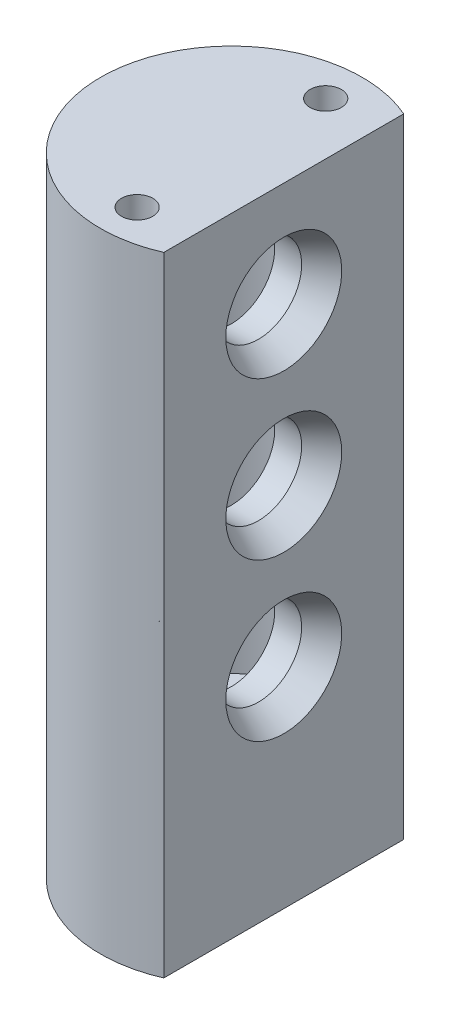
ISO-10303-21;
HEADER;
FILE_DESCRIPTION(('STEP AP214'),'2;1');
FILE_NAME('part.step','',(''),(''),'','','');
FILE_SCHEMA(('AUTOMOTIVE_DESIGN { 1 0 10303 214 1 1 1 1 }'));
ENDSEC;
DATA;
#1=APPLICATION_CONTEXT('core data for automotive mechanical design processes');
#2=APPLICATION_PROTOCOL_DEFINITION('international standard','automotive_design',2000,#1);
#3=PRODUCT_CONTEXT('',#1,'mechanical');
#4=PRODUCT('Part','Part','',(#3));
#5=PRODUCT_RELATED_PRODUCT_CATEGORY('part','',(#4));
#6=PRODUCT_DEFINITION_FORMATION('','',#4);
#7=PRODUCT_DEFINITION_CONTEXT('part definition',#1,'design');
#8=PRODUCT_DEFINITION('design','',#6,#7);
#9=PRODUCT_DEFINITION_SHAPE('','',#8);
#10=(LENGTH_UNIT() NAMED_UNIT(*) SI_UNIT(.MILLI.,.METRE.));
#11=(NAMED_UNIT(*) PLANE_ANGLE_UNIT() SI_UNIT($,.RADIAN.));
#12=(NAMED_UNIT(*) SI_UNIT($,.STERADIAN.) SOLID_ANGLE_UNIT());
#13=UNCERTAINTY_MEASURE_WITH_UNIT(LENGTH_MEASURE(1.E-05),#10,'distance_accuracy_value','');
#14=(GEOMETRIC_REPRESENTATION_CONTEXT(3) GLOBAL_UNCERTAINTY_ASSIGNED_CONTEXT((#13)) GLOBAL_UNIT_ASSIGNED_CONTEXT((#10,
#11,#12)) REPRESENTATION_CONTEXT('',''));
#15=CARTESIAN_POINT('',(0.,0.,0.));
#16=DIRECTION('',(0.,0.,1.));
#17=DIRECTION('',(1.,0.,0.));
#18=AXIS2_PLACEMENT_3D('',#15,#16,#17);
#19=CARTESIAN_POINT('',(0.,71.12,0.));
#20=DIRECTION('',(0.,1.,0.));
#21=DIRECTION('',(0.,0.,1.));
#22=AXIS2_PLACEMENT_3D('',#19,#20,#21);
#23=PLANE('',#22);
#24=CARTESIAN_POINT('',(0.,71.12,0.));
#25=DIRECTION('',(0.,1.,0.));
#26=DIRECTION('',(0.,0.,1.));
#27=AXIS2_PLACEMENT_3D('',#24,#25,#26);
#28=CIRCLE('',#27,8.89);
#29=CARTESIAN_POINT('',(0.,71.12,-8.89));
#30=VERTEX_POINT('',#29);
#31=CARTESIAN_POINT('',(0.,71.12,8.89));
#32=VERTEX_POINT('',#31);
#33=EDGE_CURVE('E178',#30,#32,#28,.T.);
#34=ORIENTED_EDGE('',*,*,#33,.F.);
#35=DIRECTION('',(0.,0.,-1.));
#36=VECTOR('',#35,1.);
#37=CARTESIAN_POINT('',(0.,71.12,8.89));
#38=LINE('',#37,#36);
#39=EDGE_CURVE('E163',#32,#30,#38,.T.);
#40=ORIENTED_EDGE('',*,*,#39,.F.);
#41=EDGE_LOOP('',(#34,#40));
#42=FACE_BOUND('',#41,.T.);
#43=CARTESIAN_POINT('',(-6.11480234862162,71.12,0.));
#44=DIRECTION('',(0.,1.,0.));
#45=DIRECTION('',(0.,0.,1.));
#46=AXIS2_PLACEMENT_3D('',#43,#44,#45);
#47=CIRCLE('',#46,1.524);
#48=CARTESIAN_POINT('',(-6.11480234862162,71.12,1.524));
#49=VERTEX_POINT('',#48);
#50=EDGE_CURVE('E209',#49,#49,#47,.F.);
#51=ORIENTED_EDGE('',*,*,#50,.F.);
#52=EDGE_LOOP('',(#51));
#53=FACE_BOUND('',#52,.T.);
#54=ADVANCED_FACE('F128',(#42,#53),#23,.F.);
#55=CARTESIAN_POINT('',(0.,11.43,0.));
#56=DIRECTION('',(0.,-1.,0.));
#57=DIRECTION('',(0.,0.,-1.));
#58=AXIS2_PLACEMENT_3D('',#55,#56,#57);
#59=CYLINDRICAL_SURFACE('',#58,0.889);
#60=CARTESIAN_POINT('',(0.,11.43,0.));
#61=DIRECTION('',(0.,1.,0.));
#62=DIRECTION('',(0.,0.,-1.));
#63=AXIS2_PLACEMENT_3D('',#60,#61,#62);
#64=CIRCLE('',#63,0.889);
#65=CARTESIAN_POINT('',(0.888999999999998,11.4299999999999,0.));
#66=VERTEX_POINT('',#65);
#67=EDGE_CURVE('E600',#66,#66,#64,.T.);
#68=ORIENTED_EDGE('',*,*,#67,.T.);
#69=EDGE_LOOP('',(#68));
#70=FACE_BOUND('',#69,.T.);
#71=CARTESIAN_POINT('',(0.,10.16,0.));
#72=DIRECTION('',(0.,-1.,0.));
#73=DIRECTION('',(0.,0.,-1.));
#74=AXIS2_PLACEMENT_3D('',#71,#72,#73);
#75=CIRCLE('',#74,0.889);
#76=CARTESIAN_POINT('',(0.,10.16,-0.889));
#77=VERTEX_POINT('',#76);
#78=EDGE_CURVE('E210',#77,#77,#75,.T.);
#79=ORIENTED_EDGE('',*,*,#78,.T.);
#80=EDGE_LOOP('',(#79));
#81=FACE_BOUND('',#80,.T.);
#82=ADVANCED_FACE('F248',(#70,#81),#59,.F.);
#83=CARTESIAN_POINT('',(6.35,76.2,14.5496778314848));
#84=DIRECTION('',(-1.,0.,0.));
#85=DIRECTION('',(0.,0.,1.));
#86=AXIS2_PLACEMENT_3D('',#83,#84,#85);
#87=PLANE('',#86);
#88=CARTESIAN_POINT('',(6.35,63.5,0.));
#89=DIRECTION('',(-1.,0.,0.));
#90=DIRECTION('',(0.,0.,1.));
#91=AXIS2_PLACEMENT_3D('',#88,#89,#90);
#92=CIRCLE('',#91,7.028);
#93=CARTESIAN_POINT('',(6.35,63.5,7.028));
#94=VERTEX_POINT('',#93);
#95=EDGE_CURVE('E226',#94,#94,#92,.T.);
#96=ORIENTED_EDGE('',*,*,#95,.T.);
#97=EDGE_LOOP('',(#96));
#98=FACE_BOUND('',#97,.T.);
#99=CARTESIAN_POINT('',(6.35,44.45,0.));
#100=DIRECTION('',(-1.,0.,0.));
#101=DIRECTION('',(0.,0.,1.));
#102=AXIS2_PLACEMENT_3D('',#99,#100,#101);
#103=CIRCLE('',#102,7.028);
#104=CARTESIAN_POINT('',(6.35,44.45,-7.028));
#105=VERTEX_POINT('',#104);
#106=EDGE_CURVE('E223',#105,#105,#103,.T.);
#107=ORIENTED_EDGE('',*,*,#106,.T.);
#108=EDGE_LOOP('',(#107));
#109=FACE_BOUND('',#108,.T.);
#110=CARTESIAN_POINT('',(6.35,25.4,0.));
#111=DIRECTION('',(-1.,0.,0.));
#112=DIRECTION('',(0.,0.,1.));
#113=AXIS2_PLACEMENT_3D('',#110,#111,#112);
#114=CIRCLE('',#113,7.02799999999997);
#115=CARTESIAN_POINT('',(6.35,25.4,7.02799999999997));
#116=VERTEX_POINT('',#115);
#117=EDGE_CURVE('E220',#116,#116,#114,.T.);
#118=ORIENTED_EDGE('',*,*,#117,.T.);
#119=EDGE_LOOP('',(#118));
#120=FACE_BOUND('',#119,.T.);
#121=DIRECTION('',(0.,0.,-1.));
#122=VECTOR('',#121,1.);
#123=CARTESIAN_POINT('',(6.35,0.,14.5496778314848));
#124=LINE('',#123,#122);
#125=CARTESIAN_POINT('',(6.35,0.,14.5496778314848));
#126=VERTEX_POINT('',#125);
#127=CARTESIAN_POINT('',(6.35,0.,-14.5496778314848));
#128=VERTEX_POINT('',#127);
#129=EDGE_CURVE('E154',#126,#128,#124,.T.);
#130=ORIENTED_EDGE('',*,*,#129,.T.);
#131=DIRECTION('',(0.,-1.,0.));
#132=VECTOR('',#131,1.);
#133=CARTESIAN_POINT('',(6.35,76.2,-14.5496778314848));
#134=LINE('',#133,#132);
#135=CARTESIAN_POINT('',(6.35,76.2,-14.5496778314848));
#136=VERTEX_POINT('',#135);
#137=EDGE_CURVE('E201',#136,#128,#134,.T.);
#138=ORIENTED_EDGE('',*,*,#137,.F.);
#139=DIRECTION('',(0.,0.,-1.));
#140=VECTOR('',#139,1.);
#141=CARTESIAN_POINT('',(6.35,76.2,14.5496778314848));
#142=LINE('',#141,#140);
#143=CARTESIAN_POINT('',(6.35,76.2,14.5496778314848));
#144=VERTEX_POINT('',#143);
#145=EDGE_CURVE('E144',#144,#136,#142,.T.);
#146=ORIENTED_EDGE('',*,*,#145,.F.);
#147=DIRECTION('',(0.,-1.,0.));
#148=VECTOR('',#147,1.);
#149=CARTESIAN_POINT('',(6.35,76.2,14.5496778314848));
#150=LINE('',#149,#148);
#151=EDGE_CURVE('E207',#144,#126,#150,.T.);
#152=ORIENTED_EDGE('',*,*,#151,.T.);
#153=EDGE_LOOP('',(#130,#138,#146,#152));
#154=FACE_BOUND('',#153,.T.);
#155=ADVANCED_FACE('F254',(#98,#109,#120,#154),#87,.F.);
#156=CARTESIAN_POINT('',(0.,71.12,0.));
#157=DIRECTION('',(0.,-1.,0.));
#158=DIRECTION('',(0.,0.,-1.));
#159=AXIS2_PLACEMENT_3D('',#156,#157,#158);
#160=CYLINDRICAL_SURFACE('',#159,8.89);
#161=CARTESIAN_POINT('',(0.,15.24,0.));
#162=DIRECTION('',(0.,1.,0.));
#163=DIRECTION('',(0.,0.,1.));
#164=AXIS2_PLACEMENT_3D('',#161,#162,#163);
#165=CIRCLE('',#164,8.89);
#166=CARTESIAN_POINT('',(0.,15.24,-8.89));
#167=VERTEX_POINT('',#166);
#168=CARTESIAN_POINT('',(0.,15.24,8.89));
#169=VERTEX_POINT('',#168);
#170=EDGE_CURVE('E176',#167,#169,#165,.T.);
#171=ORIENTED_EDGE('',*,*,#170,.F.);
#172=DIRECTION('',(0.,-1.,0.));
#173=VECTOR('',#172,1.);
#174=CARTESIAN_POINT('',(0.,71.12,-8.89));
#175=LINE('',#174,#173);
#176=EDGE_CURVE('E180',#30,#167,#175,.T.);
#177=ORIENTED_EDGE('',*,*,#176,.F.);
#178=ORIENTED_EDGE('',*,*,#33,.T.);
#179=DIRECTION('',(0.,-1.,0.));
#180=VECTOR('',#179,1.);
#181=CARTESIAN_POINT('',(0.,71.12,8.89));
#182=LINE('',#181,#180);
#183=EDGE_CURVE('E185',#32,#169,#182,.T.);
#184=ORIENTED_EDGE('',*,*,#183,.T.);
#185=EDGE_LOOP('',(#171,#177,#178,#184));
#186=FACE_BOUND('',#185,.T.);
#187=ADVANCED_FACE('F187',(#186),#160,.F.);
#188=CARTESIAN_POINT('',(0.,71.12,8.89));
#189=DIRECTION('',(-1.,0.,0.));
#190=DIRECTION('',(0.,0.,1.));
#191=AXIS2_PLACEMENT_3D('',#188,#189,#190);
#192=PLANE('',#191);
#193=CARTESIAN_POINT('',(0.,44.45,0.));
#194=DIRECTION('',(-1.,0.,0.));
#195=DIRECTION('',(0.,0.,1.));
#196=AXIS2_PLACEMENT_3D('',#193,#194,#195);
#197=CIRCLE('',#196,5.24999999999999);
#198=CARTESIAN_POINT('',(0.,44.45,5.24999999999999));
#199=VERTEX_POINT('',#198);
#200=EDGE_CURVE('E603',#199,#199,#197,.T.);
#201=ORIENTED_EDGE('',*,*,#200,.F.);
#202=EDGE_LOOP('',(#201));
#203=FACE_BOUND('',#202,.T.);
#204=CARTESIAN_POINT('',(0.,63.5,0.));
#205=DIRECTION('',(-1.,0.,0.));
#206=DIRECTION('',(0.,0.,1.));
#207=AXIS2_PLACEMENT_3D('',#204,#205,#206);
#208=CIRCLE('',#207,5.25);
#209=CARTESIAN_POINT('',(0.,63.5,5.25));
#210=VERTEX_POINT('',#209);
#211=EDGE_CURVE('E191',#210,#210,#208,.T.);
#212=ORIENTED_EDGE('',*,*,#211,.F.);
#213=EDGE_LOOP('',(#212));
#214=FACE_BOUND('',#213,.T.);
#215=CARTESIAN_POINT('',(0.,25.4,0.));
#216=DIRECTION('',(-1.,0.,0.));
#217=DIRECTION('',(0.,0.,1.));
#218=AXIS2_PLACEMENT_3D('',#215,#216,#217);
#219=CIRCLE('',#218,5.24999999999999);
#220=CARTESIAN_POINT('',(0.,25.4,5.24999999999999));
#221=VERTEX_POINT('',#220);
#222=EDGE_CURVE('E188',#221,#221,#219,.T.);
#223=ORIENTED_EDGE('',*,*,#222,.F.);
#224=EDGE_LOOP('',(#223));
#225=FACE_BOUND('',#224,.T.);
#226=DIRECTION('',(0.,0.,-1.));
#227=VECTOR('',#226,1.);
#228=CARTESIAN_POINT('',(0.,15.24,8.89));
#229=LINE('',#228,#227);
#230=EDGE_CURVE('E173',#169,#167,#229,.T.);
#231=ORIENTED_EDGE('',*,*,#230,.F.);
#232=ORIENTED_EDGE('',*,*,#183,.F.);
#233=ORIENTED_EDGE('',*,*,#39,.T.);
#234=ORIENTED_EDGE('',*,*,#176,.T.);
#235=EDGE_LOOP('',(#231,#232,#233,#234));
#236=FACE_BOUND('',#235,.T.);
#237=ADVANCED_FACE('F181',(#203,#214,#225,#236),#192,.T.);
#238=CARTESIAN_POINT('',(0.,15.24,0.));
#239=DIRECTION('',(0.,1.,0.));
#240=DIRECTION('',(0.,0.,1.));
#241=AXIS2_PLACEMENT_3D('',#238,#239,#240);
#242=PLANE('',#241);
#243=ORIENTED_EDGE('',*,*,#170,.T.);
#244=ORIENTED_EDGE('',*,*,#230,.T.);
#245=EDGE_LOOP('',(#243,#244));
#246=FACE_BOUND('',#245,.T.);
#247=ADVANCED_FACE('F174',(#246),#242,.T.);
#248=CARTESIAN_POINT('',(6.35,25.4,0.));
#249=DIRECTION('',(1.,0.,0.));
#250=DIRECTION('',(0.,0.,-1.));
#251=AXIS2_PLACEMENT_3D('',#248,#249,#250);
#252=CYLINDRICAL_SURFACE('',#251,5.24999999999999);
#253=CARTESIAN_POINT('',(3.27041366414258,25.4,0.));
#254=DIRECTION('',(-1.,0.,0.));
#255=DIRECTION('',(0.,0.,1.));
#256=AXIS2_PLACEMENT_3D('',#253,#254,#255);
#257=CIRCLE('',#256,5.24999999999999);
#258=CARTESIAN_POINT('',(3.27041366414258,25.4,5.24999999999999));
#259=VERTEX_POINT('',#258);
#260=EDGE_CURVE('E12',#259,#259,#257,.F.);
#261=ORIENTED_EDGE('',*,*,#260,.T.);
#262=EDGE_LOOP('',(#261));
#263=FACE_BOUND('',#262,.T.);
#264=ORIENTED_EDGE('',*,*,#222,.T.);
#265=EDGE_LOOP('',(#264));
#266=FACE_BOUND('',#265,.T.);
#267=ADVANCED_FACE('F260',(#263,#266),#252,.F.);
#268=CARTESIAN_POINT('',(0.,76.2,0.));
#269=DIRECTION('',(0.,-1.,0.));
#270=DIRECTION('',(0.,0.,-1.));
#271=AXIS2_PLACEMENT_3D('',#268,#269,#270);
#272=CYLINDRICAL_SURFACE('',#271,15.875);
#273=CARTESIAN_POINT('',(0.,0.,0.));
#274=DIRECTION('',(0.,1.,0.));
#275=DIRECTION('',(0.,0.,1.));
#276=AXIS2_PLACEMENT_3D('',#273,#274,#275);
#277=CIRCLE('',#276,15.875);
#278=EDGE_CURVE('E197',#128,#126,#277,.T.);
#279=ORIENTED_EDGE('',*,*,#278,.T.);
#280=ORIENTED_EDGE('',*,*,#151,.F.);
#281=CARTESIAN_POINT('',(0.,76.2,0.));
#282=DIRECTION('',(0.,1.,0.));
#283=DIRECTION('',(0.,0.,1.));
#284=AXIS2_PLACEMENT_3D('',#281,#282,#283);
#285=CIRCLE('',#284,15.875);
#286=EDGE_CURVE('E198',#136,#144,#285,.T.);
#287=ORIENTED_EDGE('',*,*,#286,.F.);
#288=ORIENTED_EDGE('',*,*,#137,.T.);
#289=EDGE_LOOP('',(#279,#280,#287,#288));
#290=FACE_BOUND('',#289,.T.);
#291=ADVANCED_FACE('F273',(#290),#272,.T.);
#292=CARTESIAN_POINT('',(0.,76.2,0.));
#293=DIRECTION('',(0.,1.,0.));
#294=DIRECTION('',(0.,0.,1.));
#295=AXIS2_PLACEMENT_3D('',#292,#293,#294);
#296=PLANE('',#295);
#297=CARTESIAN_POINT('',(0.,76.2,11.43));
#298=DIRECTION('',(0.,1.,0.));
#299=DIRECTION('',(0.,0.,1.));
#300=AXIS2_PLACEMENT_3D('',#297,#298,#299);
#301=CIRCLE('',#300,1.89864999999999);
#302=CARTESIAN_POINT('',(0.,76.2,13.32865));
#303=VERTEX_POINT('',#302);
#304=EDGE_CURVE('E637',#303,#303,#301,.T.);
#305=ORIENTED_EDGE('',*,*,#304,.F.);
#306=EDGE_LOOP('',(#305));
#307=FACE_BOUND('',#306,.T.);
#308=CARTESIAN_POINT('',(0.,76.2,-11.43));
#309=DIRECTION('',(0.,1.,0.));
#310=DIRECTION('',(0.,0.,1.));
#311=AXIS2_PLACEMENT_3D('',#308,#309,#310);
#312=CIRCLE('',#311,1.89864999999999);
#313=CARTESIAN_POINT('',(0.,76.2,-9.53135000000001));
#314=VERTEX_POINT('',#313);
#315=EDGE_CURVE('E621',#314,#314,#312,.T.);
#316=ORIENTED_EDGE('',*,*,#315,.F.);
#317=EDGE_LOOP('',(#316));
#318=FACE_BOUND('',#317,.T.);
#319=ORIENTED_EDGE('',*,*,#286,.T.);
#320=ORIENTED_EDGE('',*,*,#145,.T.);
#321=EDGE_LOOP('',(#319,#320));
#322=FACE_BOUND('',#321,.T.);
#323=ADVANCED_FACE('F269',(#307,#318,#322),#296,.T.);
#324=CARTESIAN_POINT('',(0.,0.,0.));
#325=DIRECTION('',(0.,1.,0.));
#326=DIRECTION('',(0.,0.,1.));
#327=AXIS2_PLACEMENT_3D('',#324,#325,#326);
#328=PLANE('',#327);
#329=CARTESIAN_POINT('',(0.,0.,11.43));
#330=DIRECTION('',(0.,-1.,0.));
#331=DIRECTION('',(0.,0.,-1.));
#332=AXIS2_PLACEMENT_3D('',#329,#330,#331);
#333=CIRCLE('',#332,4.20751);
#334=CARTESIAN_POINT('',(0.,0.,7.22249));
#335=VERTEX_POINT('',#334);
#336=EDGE_CURVE('E649',#335,#335,#333,.T.);
#337=ORIENTED_EDGE('',*,*,#336,.F.);
#338=EDGE_LOOP('',(#337));
#339=FACE_BOUND('',#338,.T.);
#340=CARTESIAN_POINT('',(0.,0.,-11.43));
#341=DIRECTION('',(0.,-1.,0.));
#342=DIRECTION('',(0.,0.,-1.));
#343=AXIS2_PLACEMENT_3D('',#340,#341,#342);
#344=CIRCLE('',#343,4.20751);
#345=CARTESIAN_POINT('',(0.,0.,-15.63751));
#346=VERTEX_POINT('',#345);
#347=EDGE_CURVE('E634',#346,#346,#344,.T.);
#348=ORIENTED_EDGE('',*,*,#347,.F.);
#349=EDGE_LOOP('',(#348));
#350=FACE_BOUND('',#349,.T.);
#351=CARTESIAN_POINT('',(0.,0.,0.));
#352=DIRECTION('',(0.,-1.,0.));
#353=DIRECTION('',(0.,0.,-1.));
#354=AXIS2_PLACEMENT_3D('',#351,#352,#353);
#355=CIRCLE('',#354,2.70510000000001);
#356=CARTESIAN_POINT('',(0.,0.,-2.70510000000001));
#357=VERTEX_POINT('',#356);
#358=EDGE_CURVE('E618',#357,#357,#355,.T.);
#359=ORIENTED_EDGE('',*,*,#358,.F.);
#360=EDGE_LOOP('',(#359));
#361=FACE_BOUND('',#360,.T.);
#362=ORIENTED_EDGE('',*,*,#278,.F.);
#363=ORIENTED_EDGE('',*,*,#129,.F.);
#364=EDGE_LOOP('',(#362,#363));
#365=FACE_BOUND('',#364,.T.);
#366=ADVANCED_FACE('F272',(#339,#350,#361,#365),#328,.F.);
#367=CARTESIAN_POINT('',(6.35,63.5,0.));
#368=DIRECTION('',(1.,0.,0.));
#369=DIRECTION('',(0.,0.,-1.));
#370=AXIS2_PLACEMENT_3D('',#367,#368,#369);
#371=CYLINDRICAL_SURFACE('',#370,5.25);
#372=CARTESIAN_POINT('',(3.27041366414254,63.5,0.));
#373=DIRECTION('',(-1.,0.,0.));
#374=DIRECTION('',(0.,0.,1.));
#375=AXIS2_PLACEMENT_3D('',#372,#373,#374);
#376=CIRCLE('',#375,5.25);
#377=CARTESIAN_POINT('',(3.27041366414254,63.5,5.25));
#378=VERTEX_POINT('',#377);
#379=EDGE_CURVE('E217',#378,#378,#376,.F.);
#380=ORIENTED_EDGE('',*,*,#379,.T.);
#381=EDGE_LOOP('',(#380));
#382=FACE_BOUND('',#381,.T.);
#383=ORIENTED_EDGE('',*,*,#211,.T.);
#384=EDGE_LOOP('',(#383));
#385=FACE_BOUND('',#384,.T.);
#386=ADVANCED_FACE('F277',(#382,#385),#371,.F.);
#387=CARTESIAN_POINT('',(6.35,44.45,0.));
#388=DIRECTION('',(1.,0.,0.));
#389=DIRECTION('',(0.,0.,-1.));
#390=AXIS2_PLACEMENT_3D('',#387,#388,#389);
#391=CYLINDRICAL_SURFACE('',#390,5.24999999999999);
#392=CARTESIAN_POINT('',(3.27041366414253,44.45,0.));
#393=DIRECTION('',(-1.,0.,0.));
#394=DIRECTION('',(0.,0.,1.));
#395=AXIS2_PLACEMENT_3D('',#392,#393,#394);
#396=CIRCLE('',#395,5.24999999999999);
#397=CARTESIAN_POINT('',(3.27041366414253,44.45,-5.24999999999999));
#398=VERTEX_POINT('',#397);
#399=EDGE_CURVE('E137',#398,#398,#396,.F.);
#400=ORIENTED_EDGE('',*,*,#399,.T.);
#401=EDGE_LOOP('',(#400));
#402=FACE_BOUND('',#401,.T.);
#403=ORIENTED_EDGE('',*,*,#200,.T.);
#404=EDGE_LOOP('',(#403));
#405=FACE_BOUND('',#404,.T.);
#406=ADVANCED_FACE('F231',(#402,#405),#391,.F.);
#407=CARTESIAN_POINT('',(-1.27,11.43,0.));
#408=DIRECTION('',(0.,0.,-1.));
#409=DIRECTION('',(-1.,0.,0.));
#410=AXIS2_PLACEMENT_3D('',#407,#408,#409);
#411=TOROIDAL_SURFACE('',#410,1.27,0.889);
#412=CARTESIAN_POINT('',(-1.26999999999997,12.7,0.));
#413=DIRECTION('',(-1.,0.,0.));
#414=DIRECTION('',(0.,0.,-1.));
#415=AXIS2_PLACEMENT_3D('',#412,#413,#414);
#416=CIRCLE('',#415,0.889);
#417=CARTESIAN_POINT('',(-1.26999999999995,13.589,0.));
#418=VERTEX_POINT('',#417);
#419=EDGE_CURVE('E597',#418,#418,#416,.T.);
#420=CARTESIAN_POINT('',(-1.27,11.43,0.));
#421=DIRECTION('',(0.,0.,-1.));
#422=DIRECTION('',(-1.,0.,0.));
#423=AXIS2_PLACEMENT_3D('',#420,#421,#422);
#424=CIRCLE('',#423,2.159);
#425=EDGE_CURVE('',#418,#66,#424,.T.);
#426=ORIENTED_EDGE('',*,*,#419,.T.);
#427=ORIENTED_EDGE('',*,*,#67,.F.);
#428=ORIENTED_EDGE('',*,*,#425,.T.);
#429=ORIENTED_EDGE('',*,*,#425,.F.);
#430=EDGE_LOOP('',(#426,#428,#427,#429));
#431=FACE_BOUND('',#430,.T.);
#432=ADVANCED_FACE('F501',(#431),#411,.F.);
#433=CARTESIAN_POINT('',(-11.1948023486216,12.7,0.));
#434=DIRECTION('',(1.,0.,0.));
#435=DIRECTION('',(0.,1.,0.));
#436=AXIS2_PLACEMENT_3D('',#433,#434,#435);
#437=CYLINDRICAL_SURFACE('',#436,0.889);
#438=CARTESIAN_POINT('',(-11.1948023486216,12.7,0.));
#439=DIRECTION('',(-1.,0.,0.));
#440=DIRECTION('',(0.,0.,-1.));
#441=AXIS2_PLACEMENT_3D('',#438,#439,#440);
#442=CIRCLE('',#441,0.889);
#443=CARTESIAN_POINT('',(-11.1948023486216,11.811,0.));
#444=VERTEX_POINT('',#443);
#445=EDGE_CURVE('E594',#444,#444,#442,.T.);
#446=ORIENTED_EDGE('',*,*,#445,.T.);
#447=EDGE_LOOP('',(#446));
#448=FACE_BOUND('',#447,.T.);
#449=ORIENTED_EDGE('',*,*,#419,.F.);
#450=EDGE_LOOP('',(#449));
#451=FACE_BOUND('',#450,.T.);
#452=ADVANCED_FACE('F531',(#448,#451),#437,.F.);
#453=CARTESIAN_POINT('',(-11.1948023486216,13.97,0.));
#454=DIRECTION('',(0.,0.,1.));
#455=DIRECTION('',(1.,0.,0.));
#456=AXIS2_PLACEMENT_3D('',#453,#454,#455);
#457=TOROIDAL_SURFACE('',#456,1.27,0.889);
#458=CARTESIAN_POINT('',(-12.4648023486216,13.97,0.));
#459=DIRECTION('',(0.,1.,0.));
#460=DIRECTION('',(0.,0.,-1.));
#461=AXIS2_PLACEMENT_3D('',#458,#459,#460);
#462=CIRCLE('',#461,0.889);
#463=CARTESIAN_POINT('',(-13.3538023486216,13.9699999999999,0.));
#464=VERTEX_POINT('',#463);
#465=EDGE_CURVE('E591',#464,#464,#462,.T.);
#466=CARTESIAN_POINT('',(-11.1948023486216,13.97,0.));
#467=DIRECTION('',(0.,0.,1.));
#468=DIRECTION('',(1.,0.,0.));
#469=AXIS2_PLACEMENT_3D('',#466,#467,#468);
#470=CIRCLE('',#469,2.159);
#471=EDGE_CURVE('',#464,#444,#470,.T.);
#472=ORIENTED_EDGE('',*,*,#465,.T.);
#473=ORIENTED_EDGE('',*,*,#445,.F.);
#474=ORIENTED_EDGE('',*,*,#471,.T.);
#475=ORIENTED_EDGE('',*,*,#471,.F.);
#476=EDGE_LOOP('',(#472,#474,#473,#475));
#477=FACE_BOUND('',#476,.T.);
#478=ADVANCED_FACE('F538',(#477),#457,.F.);
#479=CARTESIAN_POINT('',(-12.4648023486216,72.39,0.));
#480=DIRECTION('',(0.,-1.,0.));
#481=DIRECTION('',(1.,0.,0.));
#482=AXIS2_PLACEMENT_3D('',#479,#480,#481);
#483=CYLINDRICAL_SURFACE('',#482,0.889);
#484=CARTESIAN_POINT('',(-12.4648023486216,72.39,0.));
#485=DIRECTION('',(0.,1.,0.));
#486=DIRECTION('',(0.,0.,-1.));
#487=AXIS2_PLACEMENT_3D('',#484,#485,#486);
#488=CIRCLE('',#487,0.889);
#489=CARTESIAN_POINT('',(-13.3538023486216,72.39,0.));
#490=VERTEX_POINT('',#489);
#491=EDGE_CURVE('E584',#490,#490,#488,.T.);
#492=ORIENTED_EDGE('',*,*,#491,.T.);
#493=EDGE_LOOP('',(#492));
#494=FACE_BOUND('',#493,.T.);
#495=ORIENTED_EDGE('',*,*,#465,.F.);
#496=EDGE_LOOP('',(#495));
#497=FACE_BOUND('',#496,.T.);
#498=ADVANCED_FACE('F546',(#494,#497),#483,.F.);
#499=CARTESIAN_POINT('',(-11.1948023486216,72.39,0.));
#500=DIRECTION('',(0.,0.,1.));
#501=DIRECTION('',(1.,0.,0.));
#502=AXIS2_PLACEMENT_3D('',#499,#500,#501);
#503=TOROIDAL_SURFACE('',#502,1.27000000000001,0.889);
#504=CARTESIAN_POINT('',(-11.1948023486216,73.66,0.));
#505=DIRECTION('',(1.,0.,0.));
#506=DIRECTION('',(0.,0.,-1.));
#507=AXIS2_PLACEMENT_3D('',#504,#505,#506);
#508=CIRCLE('',#507,0.889);
#509=CARTESIAN_POINT('',(-11.1948023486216,74.549,0.));
#510=VERTEX_POINT('',#509);
#511=EDGE_CURVE('E581',#510,#510,#508,.T.);
#512=CARTESIAN_POINT('',(-11.1948023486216,72.39,0.));
#513=DIRECTION('',(0.,0.,1.));
#514=DIRECTION('',(1.,0.,0.));
#515=AXIS2_PLACEMENT_3D('',#512,#513,#514);
#516=CIRCLE('',#515,2.15900000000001);
#517=EDGE_CURVE('',#510,#490,#516,.T.);
#518=ORIENTED_EDGE('',*,*,#511,.T.);
#519=ORIENTED_EDGE('',*,*,#491,.F.);
#520=ORIENTED_EDGE('',*,*,#517,.T.);
#521=ORIENTED_EDGE('',*,*,#517,.F.);
#522=EDGE_LOOP('',(#518,#520,#519,#521));
#523=FACE_BOUND('',#522,.T.);
#524=ADVANCED_FACE('F554',(#523),#503,.F.);
#525=CARTESIAN_POINT('',(-7.38480234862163,73.66,0.));
#526=DIRECTION('',(-1.,0.,0.));
#527=DIRECTION('',(0.,-1.,0.));
#528=AXIS2_PLACEMENT_3D('',#525,#526,#527);
#529=CYLINDRICAL_SURFACE('',#528,0.889);
#530=CARTESIAN_POINT('',(-7.38480234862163,73.66,0.));
#531=DIRECTION('',(1.,0.,0.));
#532=DIRECTION('',(0.,0.,-1.));
#533=AXIS2_PLACEMENT_3D('',#530,#531,#532);
#534=CIRCLE('',#533,0.889);
#535=CARTESIAN_POINT('',(-7.38480234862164,74.549,0.));
#536=VERTEX_POINT('',#535);
#537=EDGE_CURVE('E580',#536,#536,#534,.T.);
#538=ORIENTED_EDGE('',*,*,#537,.T.);
#539=EDGE_LOOP('',(#538));
#540=FACE_BOUND('',#539,.T.);
#541=ORIENTED_EDGE('',*,*,#511,.F.);
#542=EDGE_LOOP('',(#541));
#543=FACE_BOUND('',#542,.T.);
#544=ADVANCED_FACE('F562',(#540,#543),#529,.F.);
#545=CARTESIAN_POINT('',(-7.38480234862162,72.39,0.));
#546=DIRECTION('',(0.,0.,1.));
#547=DIRECTION('',(1.,0.,0.));
#548=AXIS2_PLACEMENT_3D('',#545,#546,#547);
#549=TOROIDAL_SURFACE('',#548,1.27,0.889);
#550=CARTESIAN_POINT('',(-6.11480234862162,72.39,0.));
#551=DIRECTION('',(0.,-1.,0.));
#552=DIRECTION('',(0.,0.,-1.));
#553=AXIS2_PLACEMENT_3D('',#550,#551,#552);
#554=CIRCLE('',#553,0.889);
#555=CARTESIAN_POINT('',(-5.22580234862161,72.39,0.));
#556=VERTEX_POINT('',#555);
#557=EDGE_CURVE('E213',#556,#556,#554,.T.);
#558=CARTESIAN_POINT('',(-7.38480234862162,72.39,0.));
#559=DIRECTION('',(0.,0.,1.));
#560=DIRECTION('',(1.,0.,0.));
#561=AXIS2_PLACEMENT_3D('',#558,#559,#560);
#562=CIRCLE('',#561,2.159);
#563=EDGE_CURVE('',#556,#536,#562,.T.);
#564=ORIENTED_EDGE('',*,*,#557,.T.);
#565=ORIENTED_EDGE('',*,*,#537,.F.);
#566=ORIENTED_EDGE('',*,*,#563,.T.);
#567=ORIENTED_EDGE('',*,*,#563,.F.);
#568=EDGE_LOOP('',(#564,#566,#565,#567));
#569=FACE_BOUND('',#568,.T.);
#570=ADVANCED_FACE('F330',(#569),#549,.F.);
#571=CARTESIAN_POINT('',(-6.11480234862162,72.39,0.));
#572=DIRECTION('',(0.,-1.,0.));
#573=DIRECTION('',(1.,0.,0.));
#574=AXIS2_PLACEMENT_3D('',#571,#572,#573);
#575=CYLINDRICAL_SURFACE('',#574,0.889);
#576=ORIENTED_EDGE('',*,*,#557,.F.);
#577=EDGE_LOOP('',(#576));
#578=FACE_BOUND('',#577,.T.);
#579=CARTESIAN_POINT('',(-6.11480234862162,66.04,0.));
#580=DIRECTION('',(0.,-1.,0.));
#581=DIRECTION('',(0.,0.,-1.));
#582=AXIS2_PLACEMENT_3D('',#579,#580,#581);
#583=CIRCLE('',#582,0.889);
#584=CARTESIAN_POINT('',(-6.11480234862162,66.04,-0.889));
#585=VERTEX_POINT('',#584);
#586=EDGE_CURVE('E655',#585,#585,#583,.T.);
#587=ORIENTED_EDGE('',*,*,#586,.T.);
#588=EDGE_LOOP('',(#587));
#589=FACE_BOUND('',#588,.T.);
#590=ADVANCED_FACE('F340',(#578,#589),#575,.F.);
#591=CARTESIAN_POINT('',(0.,10.16,0.));
#592=DIRECTION('',(0.,-1.,0.));
#593=DIRECTION('',(0.,0.,-1.));
#594=AXIS2_PLACEMENT_3D('',#591,#592,#593);
#595=CYLINDRICAL_SURFACE('',#594,2.70510000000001);
#596=CARTESIAN_POINT('',(0.,10.16,0.));
#597=DIRECTION('',(0.,-1.,0.));
#598=DIRECTION('',(0.,0.,-1.));
#599=AXIS2_PLACEMENT_3D('',#596,#597,#598);
#600=CIRCLE('',#599,2.70510000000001);
#601=CARTESIAN_POINT('',(0.,10.16,-2.70510000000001));
#602=VERTEX_POINT('',#601);
#603=EDGE_CURVE('E214',#602,#602,#600,.T.);
#604=ORIENTED_EDGE('',*,*,#603,.F.);
#605=EDGE_LOOP('',(#604));
#606=FACE_BOUND('',#605,.T.);
#607=ORIENTED_EDGE('',*,*,#358,.T.);
#608=EDGE_LOOP('',(#607));
#609=FACE_BOUND('',#608,.T.);
#610=ADVANCED_FACE('F335',(#606,#609),#595,.F.);
#611=CARTESIAN_POINT('',(0.,10.16,0.));
#612=DIRECTION('',(0.,-1.,0.));
#613=DIRECTION('',(0.,0.,-1.));
#614=AXIS2_PLACEMENT_3D('',#611,#612,#613);
#615=PLANE('',#614);
#616=ORIENTED_EDGE('',*,*,#78,.F.);
#617=EDGE_LOOP('',(#616));
#618=FACE_BOUND('',#617,.T.);
#619=ORIENTED_EDGE('',*,*,#603,.T.);
#620=EDGE_LOOP('',(#619));
#621=FACE_BOUND('',#620,.T.);
#622=ADVANCED_FACE('F339',(#618,#621),#615,.T.);
#623=CARTESIAN_POINT('',(0.,0.,-11.43));
#624=DIRECTION('',(0.,-1.,0.));
#625=DIRECTION('',(0.,0.,-1.));
#626=AXIS2_PLACEMENT_3D('',#623,#624,#625);
#627=CYLINDRICAL_SURFACE('',#626,1.89864999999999);
#628=CARTESIAN_POINT('',(0.,10.16,-11.43));
#629=DIRECTION('',(0.,-1.,0.));
#630=DIRECTION('',(0.,0.,-1.));
#631=AXIS2_PLACEMENT_3D('',#628,#629,#630);
#632=CIRCLE('',#631,1.89865000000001);
#633=CARTESIAN_POINT('',(0.,10.16,-13.32865));
#634=VERTEX_POINT('',#633);
#635=EDGE_CURVE('E625',#634,#634,#632,.T.);
#636=ORIENTED_EDGE('',*,*,#635,.T.);
#637=EDGE_LOOP('',(#636));
#638=FACE_BOUND('',#637,.T.);
#639=ORIENTED_EDGE('',*,*,#315,.T.);
#640=EDGE_LOOP('',(#639));
#641=FACE_BOUND('',#640,.T.);
#642=ADVANCED_FACE('F351',(#638,#641),#627,.F.);
#643=CARTESIAN_POINT('',(3.57251,10.16,-11.43));
#644=DIRECTION('',(0.,1.,0.));
#645=DIRECTION('',(0.,0.,1.));
#646=AXIS2_PLACEMENT_3D('',#643,#644,#645);
#647=PLANE('',#646);
#648=ORIENTED_EDGE('',*,*,#635,.F.);
#649=EDGE_LOOP('',(#648));
#650=FACE_BOUND('',#649,.T.);
#651=CARTESIAN_POINT('',(0.,10.16,-11.43));
#652=DIRECTION('',(0.,-1.,0.));
#653=DIRECTION('',(0.,0.,-1.));
#654=AXIS2_PLACEMENT_3D('',#651,#652,#653);
#655=CIRCLE('',#654,3.57251);
#656=CARTESIAN_POINT('',(0.,10.16,-15.00251));
#657=VERTEX_POINT('',#656);
#658=EDGE_CURVE('E628',#657,#657,#655,.T.);
#659=ORIENTED_EDGE('',*,*,#658,.T.);
#660=EDGE_LOOP('',(#659));
#661=FACE_BOUND('',#660,.T.);
#662=ADVANCED_FACE('F375',(#650,#661),#647,.F.);
#663=CARTESIAN_POINT('',(0.,0.,-11.43));
#664=DIRECTION('',(0.,-1.,0.));
#665=DIRECTION('',(0.,0.,-1.));
#666=AXIS2_PLACEMENT_3D('',#663,#664,#665);
#667=CYLINDRICAL_SURFACE('',#666,3.57251);
#668=ORIENTED_EDGE('',*,*,#658,.F.);
#669=EDGE_LOOP('',(#668));
#670=FACE_BOUND('',#669,.T.);
#671=CARTESIAN_POINT('',(0.,0.634999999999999,-11.43));
#672=DIRECTION('',(0.,-1.,0.));
#673=DIRECTION('',(0.,0.,-1.));
#674=AXIS2_PLACEMENT_3D('',#671,#672,#673);
#675=CIRCLE('',#674,3.57251);
#676=CARTESIAN_POINT('',(0.,0.634999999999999,-15.00251));
#677=VERTEX_POINT('',#676);
#678=EDGE_CURVE('E631',#677,#677,#675,.T.);
#679=ORIENTED_EDGE('',*,*,#678,.T.);
#680=EDGE_LOOP('',(#679));
#681=FACE_BOUND('',#680,.T.);
#682=ADVANCED_FACE('F385',(#670,#681),#667,.F.);
#683=CARTESIAN_POINT('',(0.,0.,-11.43));
#684=DIRECTION('',(0.,-1.,0.));
#685=DIRECTION('',(0.,0.,-1.));
#686=AXIS2_PLACEMENT_3D('',#683,#684,#685);
#687=CONICAL_SURFACE('',#686,4.20751,0.785398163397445);
#688=ORIENTED_EDGE('',*,*,#678,.F.);
#689=EDGE_LOOP('',(#688));
#690=FACE_BOUND('',#689,.T.);
#691=ORIENTED_EDGE('',*,*,#347,.T.);
#692=EDGE_LOOP('',(#691));
#693=FACE_BOUND('',#692,.T.);
#694=ADVANCED_FACE('F395',(#690,#693),#687,.F.);
#695=CARTESIAN_POINT('',(0.,0.,11.43));
#696=DIRECTION('',(0.,-1.,0.));
#697=DIRECTION('',(0.,0.,-1.));
#698=AXIS2_PLACEMENT_3D('',#695,#696,#697);
#699=CYLINDRICAL_SURFACE('',#698,1.89864999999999);
#700=CARTESIAN_POINT('',(0.,10.16,11.43));
#701=DIRECTION('',(0.,-1.,0.));
#702=DIRECTION('',(0.,0.,-1.));
#703=AXIS2_PLACEMENT_3D('',#700,#701,#702);
#704=CIRCLE('',#703,1.89865000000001);
#705=CARTESIAN_POINT('',(0.,10.16,9.53134999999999));
#706=VERTEX_POINT('',#705);
#707=EDGE_CURVE('E640',#706,#706,#704,.T.);
#708=ORIENTED_EDGE('',*,*,#707,.T.);
#709=EDGE_LOOP('',(#708));
#710=FACE_BOUND('',#709,.T.);
#711=ORIENTED_EDGE('',*,*,#304,.T.);
#712=EDGE_LOOP('',(#711));
#713=FACE_BOUND('',#712,.T.);
#714=ADVANCED_FACE('F405',(#710,#713),#699,.F.);
#715=CARTESIAN_POINT('',(3.57251,10.16,11.43));
#716=DIRECTION('',(0.,1.,0.));
#717=DIRECTION('',(0.,0.,1.));
#718=AXIS2_PLACEMENT_3D('',#715,#716,#717);
#719=PLANE('',#718);
#720=ORIENTED_EDGE('',*,*,#707,.F.);
#721=EDGE_LOOP('',(#720));
#722=FACE_BOUND('',#721,.T.);
#723=CARTESIAN_POINT('',(0.,10.16,11.43));
#724=DIRECTION('',(0.,-1.,0.));
#725=DIRECTION('',(0.,0.,-1.));
#726=AXIS2_PLACEMENT_3D('',#723,#724,#725);
#727=CIRCLE('',#726,3.57251);
#728=CARTESIAN_POINT('',(0.,10.16,7.85749));
#729=VERTEX_POINT('',#728);
#730=EDGE_CURVE('E643',#729,#729,#727,.T.);
#731=ORIENTED_EDGE('',*,*,#730,.T.);
#732=EDGE_LOOP('',(#731));
#733=FACE_BOUND('',#732,.T.);
#734=ADVANCED_FACE('F415',(#722,#733),#719,.F.);
#735=CARTESIAN_POINT('',(0.,0.,11.43));
#736=DIRECTION('',(0.,-1.,0.));
#737=DIRECTION('',(0.,0.,-1.));
#738=AXIS2_PLACEMENT_3D('',#735,#736,#737);
#739=CYLINDRICAL_SURFACE('',#738,3.57251);
#740=ORIENTED_EDGE('',*,*,#730,.F.);
#741=EDGE_LOOP('',(#740));
#742=FACE_BOUND('',#741,.T.);
#743=CARTESIAN_POINT('',(0.,0.634999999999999,11.43));
#744=DIRECTION('',(0.,-1.,0.));
#745=DIRECTION('',(0.,0.,-1.));
#746=AXIS2_PLACEMENT_3D('',#743,#744,#745);
#747=CIRCLE('',#746,3.57251);
#748=CARTESIAN_POINT('',(0.,0.634999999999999,7.85749));
#749=VERTEX_POINT('',#748);
#750=EDGE_CURVE('E646',#749,#749,#747,.T.);
#751=ORIENTED_EDGE('',*,*,#750,.T.);
#752=EDGE_LOOP('',(#751));
#753=FACE_BOUND('',#752,.T.);
#754=ADVANCED_FACE('F425',(#742,#753),#739,.F.);
#755=CARTESIAN_POINT('',(0.,0.,11.43));
#756=DIRECTION('',(0.,-1.,0.));
#757=DIRECTION('',(0.,0.,-1.));
#758=AXIS2_PLACEMENT_3D('',#755,#756,#757);
#759=CONICAL_SURFACE('',#758,4.20751,0.785398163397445);
#760=ORIENTED_EDGE('',*,*,#750,.F.);
#761=EDGE_LOOP('',(#760));
#762=FACE_BOUND('',#761,.T.);
#763=ORIENTED_EDGE('',*,*,#336,.T.);
#764=EDGE_LOOP('',(#763));
#765=FACE_BOUND('',#764,.T.);
#766=ADVANCED_FACE('F435',(#762,#765),#759,.F.);
#767=CARTESIAN_POINT('',(-6.11480234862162,66.04,0.));
#768=DIRECTION('',(0.,-1.,0.));
#769=DIRECTION('',(0.,0.,-1.));
#770=AXIS2_PLACEMENT_3D('',#767,#768,#769);
#771=PLANE('',#770);
#772=CARTESIAN_POINT('',(-6.11480234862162,66.04,0.));
#773=DIRECTION('',(0.,-1.,0.));
#774=DIRECTION('',(0.,0.,-1.));
#775=AXIS2_PLACEMENT_3D('',#772,#773,#774);
#776=CIRCLE('',#775,1.524);
#777=CARTESIAN_POINT('',(-6.11480234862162,66.04,-1.524));
#778=VERTEX_POINT('',#777);
#779=EDGE_CURVE('E652',#778,#778,#776,.T.);
#780=ORIENTED_EDGE('',*,*,#779,.T.);
#781=EDGE_LOOP('',(#780));
#782=FACE_BOUND('',#781,.T.);
#783=ORIENTED_EDGE('',*,*,#586,.F.);
#784=EDGE_LOOP('',(#783));
#785=FACE_BOUND('',#784,.T.);
#786=ADVANCED_FACE('F444',(#782,#785),#771,.T.);
#787=CARTESIAN_POINT('',(-6.11480234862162,66.04,0.));
#788=DIRECTION('',(0.,1.,0.));
#789=DIRECTION('',(0.,0.,1.));
#790=AXIS2_PLACEMENT_3D('',#787,#788,#789);
#791=CYLINDRICAL_SURFACE('',#790,1.524);
#792=ORIENTED_EDGE('',*,*,#779,.F.);
#793=EDGE_LOOP('',(#792));
#794=FACE_BOUND('',#793,.T.);
#795=ORIENTED_EDGE('',*,*,#50,.T.);
#796=EDGE_LOOP('',(#795));
#797=FACE_BOUND('',#796,.T.);
#798=ADVANCED_FACE('F243',(#794,#797),#791,.T.);
#799=CARTESIAN_POINT('',(3.27041366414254,63.5,0.));
#800=DIRECTION('',(1.,0.,0.));
#801=DIRECTION('',(0.,0.,-1.));
#802=AXIS2_PLACEMENT_3D('',#799,#800,#801);
#803=CONICAL_SURFACE('',#802,5.25,0.523598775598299);
#804=ORIENTED_EDGE('',*,*,#95,.F.);
#805=EDGE_LOOP('',(#804));
#806=FACE_BOUND('',#805,.T.);
#807=ORIENTED_EDGE('',*,*,#379,.F.);
#808=EDGE_LOOP('',(#807));
#809=FACE_BOUND('',#808,.T.);
#810=ADVANCED_FACE('F236',(#806,#809),#803,.F.);
#811=CARTESIAN_POINT('',(3.27041366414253,44.45,0.));
#812=DIRECTION('',(1.,0.,0.));
#813=DIRECTION('',(0.,0.,-1.));
#814=AXIS2_PLACEMENT_3D('',#811,#812,#813);
#815=CONICAL_SURFACE('',#814,5.24999999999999,0.5235987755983);
#816=CARTESIAN_POINT('',(6.35,44.45,-7.028));
#817=CARTESIAN_POINT('',(6.31792097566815,44.45,-7.00947916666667));
#818=CARTESIAN_POINT('',(6.2858419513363,44.45,-6.99095833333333));
#819=CARTESIAN_POINT('',(6.22168390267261,44.45,-6.95391666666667));
#820=CARTESIAN_POINT('',(6.18960487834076,44.45,-6.93539583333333));
#821=CARTESIAN_POINT('',(6.12544682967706,44.45,-6.89835416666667));
#822=CARTESIAN_POINT('',(6.09336780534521,44.45,-6.87983333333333));
#823=CARTESIAN_POINT('',(6.02920975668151,44.45,-6.84279166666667));
#824=CARTESIAN_POINT('',(5.99713073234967,44.45,-6.82427083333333));
#825=CARTESIAN_POINT('',(5.93297268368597,44.45,-6.78722916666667));
#826=CARTESIAN_POINT('',(5.90089365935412,44.45,-6.76870833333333));
#827=CARTESIAN_POINT('',(5.83673561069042,44.45,-6.73166666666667));
#828=CARTESIAN_POINT('',(5.80465658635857,44.45,-6.71314583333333));
#829=CARTESIAN_POINT('',(5.74049853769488,44.45,-6.67610416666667));
#830=CARTESIAN_POINT('',(5.70841951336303,44.45,-6.65758333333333));
#831=CARTESIAN_POINT('',(5.64426146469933,44.45,-6.62054166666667));
#832=CARTESIAN_POINT('',(5.61218244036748,44.45,-6.60202083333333));
#833=CARTESIAN_POINT('',(5.54802439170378,44.45,-6.56497916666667));
#834=CARTESIAN_POINT('',(5.51594536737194,44.45,-6.54645833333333));
#835=CARTESIAN_POINT('',(5.45178731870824,44.45,-6.50941666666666));
#836=CARTESIAN_POINT('',(5.41970829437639,44.45,-6.49089583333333));
#837=CARTESIAN_POINT('',(5.35555024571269,44.45,-6.45385416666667));
#838=CARTESIAN_POINT('',(5.32347122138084,44.45,-6.43533333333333));
#839=CARTESIAN_POINT('',(5.25931317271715,44.45,-6.39829166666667));
#840=CARTESIAN_POINT('',(5.2272341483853,44.45,-6.37977083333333));
#841=CARTESIAN_POINT('',(5.1630760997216,44.45,-6.34272916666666));
#842=CARTESIAN_POINT('',(5.13099707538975,44.45,-6.32420833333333));
#843=CARTESIAN_POINT('',(5.06683902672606,44.45,-6.28716666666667));
#844=CARTESIAN_POINT('',(5.03476000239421,44.45,-6.26864583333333));
#845=CARTESIAN_POINT('',(4.97060195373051,44.45,-6.23160416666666));
#846=CARTESIAN_POINT('',(4.93852292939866,44.45,-6.21308333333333));
#847=CARTESIAN_POINT('',(4.87436488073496,44.45,-6.17604166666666));
#848=CARTESIAN_POINT('',(4.84228585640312,44.45,-6.15752083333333));
#849=CARTESIAN_POINT('',(4.77812780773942,44.45,-6.12047916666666));
#850=CARTESIAN_POINT('',(4.74604878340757,44.45,-6.10195833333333));
#851=CARTESIAN_POINT('',(4.68189073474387,44.45,-6.06491666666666));
#852=CARTESIAN_POINT('',(4.64981171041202,44.45,-6.04639583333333));
#853=CARTESIAN_POINT('',(4.58565366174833,44.45,-6.00935416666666));
#854=CARTESIAN_POINT('',(4.55357463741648,44.45,-5.99083333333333));
#855=CARTESIAN_POINT('',(4.48941658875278,44.45,-5.95379166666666));
#856=CARTESIAN_POINT('',(4.45733756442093,44.45,-5.93527083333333));
#857=CARTESIAN_POINT('',(4.39317951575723,44.45,-5.89822916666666));
#858=CARTESIAN_POINT('',(4.36110049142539,44.45,-5.87970833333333));
#859=CARTESIAN_POINT('',(4.29694244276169,44.45,-5.84266666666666));
#860=CARTESIAN_POINT('',(4.26486341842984,44.45,-5.82414583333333));
#861=CARTESIAN_POINT('',(4.20070536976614,44.45,-5.78710416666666));
#862=CARTESIAN_POINT('',(4.16862634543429,44.45,-5.76858333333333));
#863=CARTESIAN_POINT('',(4.1044682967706,44.45,-5.73154166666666));
#864=CARTESIAN_POINT('',(4.07238927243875,44.45,-5.71302083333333));
#865=CARTESIAN_POINT('',(4.00823122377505,44.45,-5.67597916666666));
#866=CARTESIAN_POINT('',(3.9761521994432,44.45,-5.65745833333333));
#867=CARTESIAN_POINT('',(3.9119941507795,44.45,-5.62041666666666));
#868=CARTESIAN_POINT('',(3.87991512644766,44.45,-5.60189583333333));
#869=CARTESIAN_POINT('',(3.81575707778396,44.45,-5.56485416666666));
#870=CARTESIAN_POINT('',(3.78367805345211,44.45,-5.54633333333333));
#871=CARTESIAN_POINT('',(3.71952000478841,44.45,-5.50929166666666));
#872=CARTESIAN_POINT('',(3.68744098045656,44.45,-5.49077083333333));
#873=CARTESIAN_POINT('',(3.62328293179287,44.45,-5.45372916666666));
#874=CARTESIAN_POINT('',(3.59120390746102,44.45,-5.43520833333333));
#875=CARTESIAN_POINT('',(3.52704585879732,44.45,-5.39816666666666));
#876=CARTESIAN_POINT('',(3.49496683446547,44.45,-5.37964583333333));
#877=CARTESIAN_POINT('',(3.43080878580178,44.45,-5.34260416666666));
#878=CARTESIAN_POINT('',(3.39872976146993,44.45,-5.32408333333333));
#879=CARTESIAN_POINT('',(3.33457171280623,44.45,-5.28704166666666));
#880=CARTESIAN_POINT('',(3.30249268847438,44.45,-5.26852083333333));
#881=CARTESIAN_POINT('',(3.27041366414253,44.45,-5.24999999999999));
#882=B_SPLINE_CURVE_WITH_KNOTS('',3,(#816,#817,#818,#819,#820,#821,#822,#823,#824,#825,#826,
#827,#828,#829,#830,#831,#832,#833,#834,#835,#836,#837,#838,#839,#840,#841,#842,#843,#844,#845,
#846,#847,#848,#849,#850,#851,#852,#853,#854,#855,#856,#857,#858,#859,#860,#861,#862,#863,#864,
#865,#866,#867,#868,#869,#870,#871,#872,#873,#874,#875,#876,#877,#878,#879,#880,#881),
.UNSPECIFIED.,.F.,.F.,(4,2,2,2,2,2,2,2,2,2,2,2,2,2,2,2,2,2,2,2,2,2,2,2,2,2,2,2,2,2,2,2,4),(0.,
0.111125,0.22225,0.333375,0.444500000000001,0.555625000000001,0.666750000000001,
0.777875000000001,0.889000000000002,1.000125,1.11125,1.222375,1.3335,1.444625,1.55575,1.666875,
1.778,1.889125,2.00025,2.111375,2.2225,2.333625,2.44475,2.55587500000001,2.66700000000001,
2.77812500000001,2.88925000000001,3.00037500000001,3.11150000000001,3.22262500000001,
3.33375000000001,3.44487500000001,3.55600000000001),.UNSPECIFIED.);
#883=EDGE_CURVE('BSEAM234',#105,#398,#882,.T.);
#884=ORIENTED_EDGE('',*,*,#106,.F.);
#885=ORIENTED_EDGE('',*,*,#399,.F.);
#886=ORIENTED_EDGE('',*,*,#883,.T.);
#887=ORIENTED_EDGE('',*,*,#883,.F.);
#888=EDGE_LOOP('',(#884,#886,#885,#887));
#889=FACE_BOUND('',#888,.T.);
#890=ADVANCED_FACE('F234',(#889),#815,.F.);
#891=CARTESIAN_POINT('',(3.27041366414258,25.4,0.));
#892=DIRECTION('',(1.,0.,0.));
#893=DIRECTION('',(0.,0.,-1.));
#894=AXIS2_PLACEMENT_3D('',#891,#892,#893);
#895=CONICAL_SURFACE('',#894,5.24999999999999,0.523598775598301);
#896=ORIENTED_EDGE('',*,*,#117,.F.);
#897=EDGE_LOOP('',(#896));
#898=FACE_BOUND('',#897,.T.);
#899=ORIENTED_EDGE('',*,*,#260,.F.);
#900=EDGE_LOOP('',(#899));
#901=FACE_BOUND('',#900,.T.);
#902=ADVANCED_FACE('F130',(#898,#901),#895,.F.);
#903=CLOSED_SHELL('',(#54,#82,#155,#187,#237,#247,#267,#291,#323,#366,#386,#406,#432,#452,#478,
#498,#524,#544,#570,#590,#610,#622,#642,#662,#682,#694,#714,#734,#754,#766,#786,#798,#810,#890,#902));
#904=MANIFOLD_SOLID_BREP('B2',#903);
#905=ADVANCED_BREP_SHAPE_REPRESENTATION('',(#18,#904),#14);
#906=SHAPE_DEFINITION_REPRESENTATION(#9,#905);
ENDSEC;
END-ISO-10303-21;
